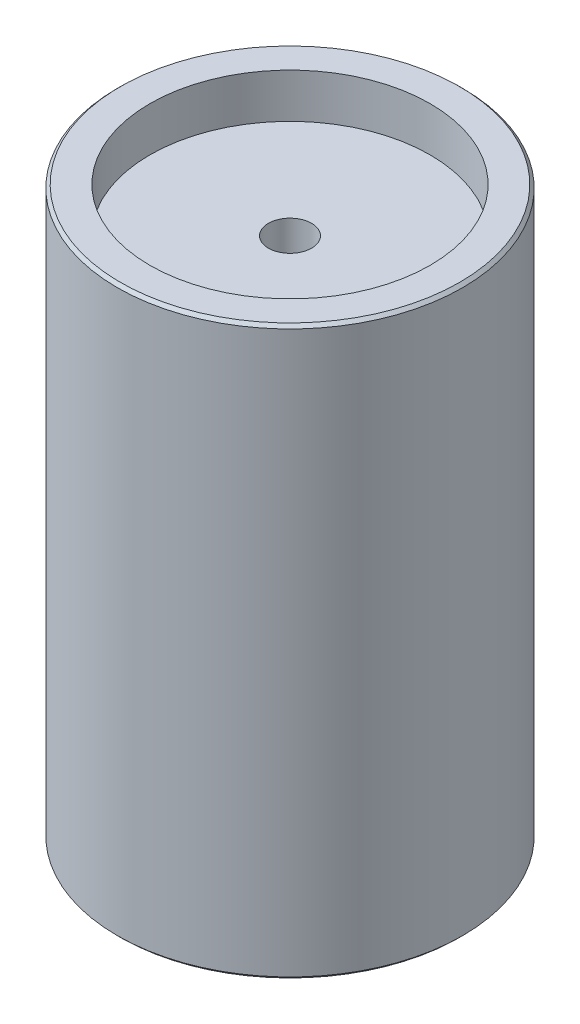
ISO-10303-21;
HEADER;
FILE_DESCRIPTION(('STEP AP214'),'2;1');
FILE_NAME('part.step','',(''),(''),'','','');
FILE_SCHEMA(('AUTOMOTIVE_DESIGN { 1 0 10303 214 1 1 1 1 }'));
ENDSEC;
DATA;
#1=APPLICATION_CONTEXT('core data for automotive mechanical design processes');
#2=APPLICATION_PROTOCOL_DEFINITION('international standard','automotive_design',2000,#1);
#3=PRODUCT_CONTEXT('',#1,'mechanical');
#4=PRODUCT('Part','Part','',(#3));
#5=PRODUCT_RELATED_PRODUCT_CATEGORY('part','',(#4));
#6=PRODUCT_DEFINITION_FORMATION('','',#4);
#7=PRODUCT_DEFINITION_CONTEXT('part definition',#1,'design');
#8=PRODUCT_DEFINITION('design','',#6,#7);
#9=PRODUCT_DEFINITION_SHAPE('','',#8);
#10=(LENGTH_UNIT() NAMED_UNIT(*) SI_UNIT(.MILLI.,.METRE.));
#11=(NAMED_UNIT(*) PLANE_ANGLE_UNIT() SI_UNIT($,.RADIAN.));
#12=(NAMED_UNIT(*) SI_UNIT($,.STERADIAN.) SOLID_ANGLE_UNIT());
#13=UNCERTAINTY_MEASURE_WITH_UNIT(LENGTH_MEASURE(1.E-05),#10,'distance_accuracy_value','');
#14=(GEOMETRIC_REPRESENTATION_CONTEXT(3) GLOBAL_UNCERTAINTY_ASSIGNED_CONTEXT((#13)) GLOBAL_UNIT_ASSIGNED_CONTEXT((#10,
#11,#12)) REPRESENTATION_CONTEXT('',''));
#15=CARTESIAN_POINT('',(0.,0.,0.));
#16=DIRECTION('',(0.,0.,1.));
#17=DIRECTION('',(1.,0.,0.));
#18=AXIS2_PLACEMENT_3D('',#15,#16,#17);
#19=CARTESIAN_POINT('',(0.,-146.05,0.));
#20=DIRECTION('',(0.,1.,0.));
#21=DIRECTION('',(-1.,0.,0.));
#22=AXIS2_PLACEMENT_3D('',#19,#20,#21);
#23=PLANE('',#22);
#24=CARTESIAN_POINT('',(0.,-146.05,31.75));
#25=DIRECTION('',(0.,-1.,0.));
#26=DIRECTION('',(0.,0.,-1.));
#27=AXIS2_PLACEMENT_3D('',#24,#25,#26);
#28=CIRCLE('',#27,2.413);
#29=CARTESIAN_POINT('',(0.,-146.05,29.337));
#30=VERTEX_POINT('',#29);
#31=EDGE_CURVE('E57',#30,#30,#28,.T.);
#32=ORIENTED_EDGE('',*,*,#31,.F.);
#33=EDGE_LOOP('',(#32));
#34=FACE_BOUND('',#33,.T.);
#35=CARTESIAN_POINT('',(0.,-146.05,0.));
#36=DIRECTION('',(0.,-1.,0.));
#37=DIRECTION('',(1.,0.,0.));
#38=AXIS2_PLACEMENT_3D('',#35,#36,#37);
#39=CIRCLE('',#38,12.7);
#40=CARTESIAN_POINT('',(12.7,-146.05,0.));
#41=VERTEX_POINT('',#40);
#42=EDGE_CURVE('E66',#41,#41,#39,.T.);
#43=ORIENTED_EDGE('',*,*,#42,.F.);
#44=EDGE_LOOP('',(#43));
#45=FACE_BOUND('',#44,.T.);
#46=CARTESIAN_POINT('',(0.,-146.05,0.));
#47=DIRECTION('',(0.,1.,0.));
#48=DIRECTION('',(-1.,0.,0.));
#49=AXIS2_PLACEMENT_3D('',#46,#47,#48);
#50=CIRCLE('',#49,43.65625);
#51=CARTESIAN_POINT('',(-43.65625,-146.05,0.));
#52=VERTEX_POINT('',#51);
#53=EDGE_CURVE('E81',#52,#52,#50,.T.);
#54=ORIENTED_EDGE('',*,*,#53,.F.);
#55=EDGE_LOOP('',(#54));
#56=FACE_BOUND('',#55,.T.);
#57=ADVANCED_FACE('F30',(#34,#45,#56),#23,.F.);
#58=CARTESIAN_POINT('',(0.,-146.05,0.));
#59=DIRECTION('',(0.,1.,0.));
#60=DIRECTION('',(-1.,0.,0.));
#61=AXIS2_PLACEMENT_3D('',#58,#59,#60);
#62=CONICAL_SURFACE('',#61,43.65625,0.785398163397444);
#63=CARTESIAN_POINT('',(0.,-145.25625,0.));
#64=DIRECTION('',(0.,1.,0.));
#65=DIRECTION('',(-1.,0.,0.));
#66=AXIS2_PLACEMENT_3D('',#63,#64,#65);
#67=CIRCLE('',#66,44.45);
#68=CARTESIAN_POINT('',(-44.45,-145.25625,0.));
#69=VERTEX_POINT('',#68);
#70=EDGE_CURVE('E78',#69,#69,#67,.T.);
#71=ORIENTED_EDGE('',*,*,#70,.F.);
#72=EDGE_LOOP('',(#71));
#73=FACE_BOUND('',#72,.T.);
#74=ORIENTED_EDGE('',*,*,#53,.T.);
#75=EDGE_LOOP('',(#74));
#76=FACE_BOUND('',#75,.T.);
#77=ADVANCED_FACE('F105',(#73,#76),#62,.T.);
#78=CARTESIAN_POINT('',(0.,0.,0.));
#79=DIRECTION('',(0.,1.,0.));
#80=DIRECTION('',(-1.,0.,0.));
#81=AXIS2_PLACEMENT_3D('',#78,#79,#80);
#82=CYLINDRICAL_SURFACE('',#81,44.45);
#83=CARTESIAN_POINT('',(0.,-0.787400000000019,0.));
#84=DIRECTION('',(0.,-1.,0.));
#85=DIRECTION('',(1.,0.,0.));
#86=AXIS2_PLACEMENT_3D('',#83,#84,#85);
#87=CIRCLE('',#86,44.45);
#88=CARTESIAN_POINT('',(44.45,-0.787400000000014,0.));
#89=VERTEX_POINT('',#88);
#90=EDGE_CURVE('E11',#89,#89,#87,.T.);
#91=ORIENTED_EDGE('',*,*,#90,.T.);
#92=EDGE_LOOP('',(#91));
#93=FACE_BOUND('',#92,.T.);
#94=ORIENTED_EDGE('',*,*,#70,.T.);
#95=EDGE_LOOP('',(#94));
#96=FACE_BOUND('',#95,.T.);
#97=ADVANCED_FACE('F110',(#93,#96),#82,.T.);
#98=CARTESIAN_POINT('',(44.45,0.,0.));
#99=DIRECTION('',(0.,-1.,0.));
#100=DIRECTION('',(1.,0.,0.));
#101=AXIS2_PLACEMENT_3D('',#98,#99,#100);
#102=PLANE('',#101);
#103=CARTESIAN_POINT('',(0.,0.,0.));
#104=DIRECTION('',(0.,-1.,0.));
#105=DIRECTION('',(1.,0.,0.));
#106=AXIS2_PLACEMENT_3D('',#103,#104,#105);
#107=CIRCLE('',#106,43.6626);
#108=CARTESIAN_POINT('',(43.6626,0.,0.));
#109=VERTEX_POINT('',#108);
#110=EDGE_CURVE('E37',#109,#109,#107,.F.);
#111=ORIENTED_EDGE('',*,*,#110,.T.);
#112=EDGE_LOOP('',(#111));
#113=FACE_BOUND('',#112,.T.);
#114=CARTESIAN_POINT('',(0.,0.,0.));
#115=DIRECTION('',(0.,1.,0.));
#116=DIRECTION('',(-1.,0.,0.));
#117=AXIS2_PLACEMENT_3D('',#114,#115,#116);
#118=CIRCLE('',#117,36.068);
#119=CARTESIAN_POINT('',(-36.068,0.,0.));
#120=VERTEX_POINT('',#119);
#121=EDGE_CURVE('E75',#120,#120,#118,.T.);
#122=ORIENTED_EDGE('',*,*,#121,.F.);
#123=EDGE_LOOP('',(#122));
#124=FACE_BOUND('',#123,.T.);
#125=ADVANCED_FACE('F86',(#113,#124),#102,.F.);
#126=CARTESIAN_POINT('',(0.,0.,0.));
#127=DIRECTION('',(0.,1.,0.));
#128=DIRECTION('',(-1.,0.,0.));
#129=AXIS2_PLACEMENT_3D('',#126,#127,#128);
#130=CYLINDRICAL_SURFACE('',#129,36.068);
#131=CARTESIAN_POINT('',(0.,-11.43,0.));
#132=DIRECTION('',(0.,1.,0.));
#133=DIRECTION('',(-1.,0.,0.));
#134=AXIS2_PLACEMENT_3D('',#131,#132,#133);
#135=CIRCLE('',#134,36.068);
#136=CARTESIAN_POINT('',(-36.068,-11.43,0.));
#137=VERTEX_POINT('',#136);
#138=EDGE_CURVE('E70',#137,#137,#135,.T.);
#139=ORIENTED_EDGE('',*,*,#138,.F.);
#140=EDGE_LOOP('',(#139));
#141=FACE_BOUND('',#140,.T.);
#142=ORIENTED_EDGE('',*,*,#121,.T.);
#143=EDGE_LOOP('',(#142));
#144=FACE_BOUND('',#143,.T.);
#145=ADVANCED_FACE('F100',(#141,#144),#130,.F.);
#146=CARTESIAN_POINT('',(36.068,-11.43,0.));
#147=DIRECTION('',(0.,-1.,0.));
#148=DIRECTION('',(1.,0.,0.));
#149=AXIS2_PLACEMENT_3D('',#146,#147,#148);
#150=PLANE('',#149);
#151=CARTESIAN_POINT('',(0.,-11.43,0.));
#152=DIRECTION('',(0.,-1.,0.));
#153=DIRECTION('',(1.,0.,0.));
#154=AXIS2_PLACEMENT_3D('',#151,#152,#153);
#155=CIRCLE('',#154,5.55624999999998);
#156=CARTESIAN_POINT('',(5.55624999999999,-11.43,0.));
#157=VERTEX_POINT('',#156);
#158=EDGE_CURVE('E63',#157,#157,#155,.T.);
#159=ORIENTED_EDGE('',*,*,#158,.T.);
#160=EDGE_LOOP('',(#159));
#161=FACE_BOUND('',#160,.T.);
#162=ORIENTED_EDGE('',*,*,#138,.T.);
#163=EDGE_LOOP('',(#162));
#164=FACE_BOUND('',#163,.T.);
#165=ADVANCED_FACE('F91',(#161,#164),#150,.F.);
#166=CARTESIAN_POINT('',(0.,0.,0.));
#167=DIRECTION('',(0.,-1.,0.));
#168=DIRECTION('',(1.,0.,0.));
#169=AXIS2_PLACEMENT_3D('',#166,#167,#168);
#170=CONICAL_SURFACE('',#169,43.6626,0.785398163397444);
#171=ORIENTED_EDGE('',*,*,#90,.F.);
#172=EDGE_LOOP('',(#171));
#173=FACE_BOUND('',#172,.T.);
#174=ORIENTED_EDGE('',*,*,#110,.F.);
#175=EDGE_LOOP('',(#174));
#176=FACE_BOUND('',#175,.T.);
#177=ADVANCED_FACE('F32',(#173,#176),#170,.T.);
#178=CARTESIAN_POINT('',(0.,-144.78,0.));
#179=DIRECTION('',(0.,-1.,0.));
#180=DIRECTION('',(1.,0.,0.));
#181=AXIS2_PLACEMENT_3D('',#178,#179,#180);
#182=CYLINDRICAL_SURFACE('',#181,12.7);
#183=CARTESIAN_POINT('',(0.,-144.78,0.));
#184=DIRECTION('',(0.,-1.,0.));
#185=DIRECTION('',(1.,0.,0.));
#186=AXIS2_PLACEMENT_3D('',#183,#184,#185);
#187=CIRCLE('',#186,12.7);
#188=CARTESIAN_POINT('',(12.7,-144.78,0.));
#189=VERTEX_POINT('',#188);
#190=EDGE_CURVE('E67',#189,#189,#187,.T.);
#191=ORIENTED_EDGE('',*,*,#190,.F.);
#192=EDGE_LOOP('',(#191));
#193=FACE_BOUND('',#192,.T.);
#194=ORIENTED_EDGE('',*,*,#42,.T.);
#195=EDGE_LOOP('',(#194));
#196=FACE_BOUND('',#195,.T.);
#197=ADVANCED_FACE('F90',(#193,#196),#182,.F.);
#198=CARTESIAN_POINT('',(0.,-144.78,0.));
#199=DIRECTION('',(0.,-1.,0.));
#200=DIRECTION('',(1.,0.,0.));
#201=AXIS2_PLACEMENT_3D('',#198,#199,#200);
#202=PLANE('',#201);
#203=CARTESIAN_POINT('',(0.,-144.78,0.));
#204=DIRECTION('',(0.,-1.,0.));
#205=DIRECTION('',(0.,0.,-1.));
#206=AXIS2_PLACEMENT_3D('',#203,#204,#205);
#207=CIRCLE('',#206,5.55624999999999);
#208=CARTESIAN_POINT('',(0.,-144.78,-5.55624999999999));
#209=VERTEX_POINT('',#208);
#210=EDGE_CURVE('E60',#209,#209,#207,.T.);
#211=ORIENTED_EDGE('',*,*,#210,.F.);
#212=EDGE_LOOP('',(#211));
#213=FACE_BOUND('',#212,.T.);
#214=ORIENTED_EDGE('',*,*,#190,.T.);
#215=EDGE_LOOP('',(#214));
#216=FACE_BOUND('',#215,.T.);
#217=ADVANCED_FACE('F97',(#213,#216),#202,.T.);
#218=CARTESIAN_POINT('',(0.,-144.78,0.));
#219=DIRECTION('',(0.,-1.,0.));
#220=DIRECTION('',(0.,0.,-1.));
#221=AXIS2_PLACEMENT_3D('',#218,#219,#220);
#222=CYLINDRICAL_SURFACE('',#221,5.55624999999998);
#223=ORIENTED_EDGE('',*,*,#210,.T.);
#224=EDGE_LOOP('',(#223));
#225=FACE_BOUND('',#224,.T.);
#226=ORIENTED_EDGE('',*,*,#158,.F.);
#227=EDGE_LOOP('',(#226));
#228=FACE_BOUND('',#227,.T.);
#229=ADVANCED_FACE('F126',(#225,#228),#222,.F.);
#230=CARTESIAN_POINT('',(0.,-146.05,31.75));
#231=DIRECTION('',(0.,-1.,0.));
#232=DIRECTION('',(0.,0.,-1.));
#233=AXIS2_PLACEMENT_3D('',#230,#231,#232);
#234=CYLINDRICAL_SURFACE('',#233,2.413);
#235=CARTESIAN_POINT('',(0.,-137.16,31.75));
#236=DIRECTION('',(0.,-1.,0.));
#237=DIRECTION('',(0.,0.,-1.));
#238=AXIS2_PLACEMENT_3D('',#235,#236,#237);
#239=CIRCLE('',#238,2.413);
#240=CARTESIAN_POINT('',(0.,-137.16,29.337));
#241=VERTEX_POINT('',#240);
#242=EDGE_CURVE('E52',#241,#241,#239,.T.);
#243=ORIENTED_EDGE('',*,*,#242,.F.);
#244=EDGE_LOOP('',(#243));
#245=FACE_BOUND('',#244,.T.);
#246=ORIENTED_EDGE('',*,*,#31,.T.);
#247=EDGE_LOOP('',(#246));
#248=FACE_BOUND('',#247,.T.);
#249=ADVANCED_FACE('F130',(#245,#248),#234,.F.);
#250=CARTESIAN_POINT('',(2.01930000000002,-137.16,31.75));
#251=DIRECTION('',(0.,1.,0.));
#252=DIRECTION('',(0.,0.,1.));
#253=AXIS2_PLACEMENT_3D('',#250,#251,#252);
#254=PLANE('',#253);
#255=CARTESIAN_POINT('',(0.,-137.16,31.75));
#256=DIRECTION('',(0.,-1.,0.));
#257=DIRECTION('',(0.,0.,-1.));
#258=AXIS2_PLACEMENT_3D('',#255,#256,#257);
#259=CIRCLE('',#258,2.0193);
#260=CARTESIAN_POINT('',(0.,-137.16,29.7307));
#261=VERTEX_POINT('',#260);
#262=EDGE_CURVE('E49',#261,#261,#259,.T.);
#263=ORIENTED_EDGE('',*,*,#262,.F.);
#264=EDGE_LOOP('',(#263));
#265=FACE_BOUND('',#264,.T.);
#266=ORIENTED_EDGE('',*,*,#242,.T.);
#267=EDGE_LOOP('',(#266));
#268=FACE_BOUND('',#267,.T.);
#269=ADVANCED_FACE('F134',(#265,#268),#254,.F.);
#270=CARTESIAN_POINT('',(0.,-146.05,31.75));
#271=DIRECTION('',(0.,-1.,0.));
#272=DIRECTION('',(0.,0.,-1.));
#273=AXIS2_PLACEMENT_3D('',#270,#271,#272);
#274=CYLINDRICAL_SURFACE('',#273,2.0193);
#275=CARTESIAN_POINT('',(0.,-135.89,31.75));
#276=DIRECTION('',(0.,-1.,0.));
#277=DIRECTION('',(0.,0.,-1.));
#278=AXIS2_PLACEMENT_3D('',#275,#276,#277);
#279=CIRCLE('',#278,2.0193);
#280=CARTESIAN_POINT('',(0.,-135.89,29.7307));
#281=VERTEX_POINT('',#280);
#282=EDGE_CURVE('E47',#281,#281,#279,.T.);
#283=ORIENTED_EDGE('',*,*,#282,.F.);
#284=EDGE_LOOP('',(#283));
#285=FACE_BOUND('',#284,.T.);
#286=ORIENTED_EDGE('',*,*,#262,.T.);
#287=EDGE_LOOP('',(#286));
#288=FACE_BOUND('',#287,.T.);
#289=ADVANCED_FACE('F43',(#285,#288),#274,.F.);
#290=CARTESIAN_POINT('',(0.,-135.89,31.75));
#291=DIRECTION('',(0.,-1.,0.));
#292=DIRECTION('',(0.,0.,-1.));
#293=AXIS2_PLACEMENT_3D('',#290,#291,#292);
#294=CONICAL_SURFACE('',#293,2.0193,1.02974425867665);
#295=CARTESIAN_POINT('',(0.,-134.676682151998,31.75));
#296=VERTEX_POINT('',#295);
#297=VERTEX_LOOP('',#296);
#298=FACE_BOUND('',#297,.T.);
#299=ORIENTED_EDGE('',*,*,#282,.T.);
#300=EDGE_LOOP('',(#299));
#301=FACE_BOUND('',#300,.T.);
#302=ADVANCED_FACE('F40',(#298,#301),#294,.F.);
#303=CLOSED_SHELL('',(#57,#77,#97,#125,#145,#165,#177,#197,#217,#229,#249,#269,#289,#302));
#304=MANIFOLD_SOLID_BREP('B2',#303);
#305=ADVANCED_BREP_SHAPE_REPRESENTATION('',(#18,#304),#14);
#306=SHAPE_DEFINITION_REPRESENTATION(#9,#305);
ENDSEC;
END-ISO-10303-21;
